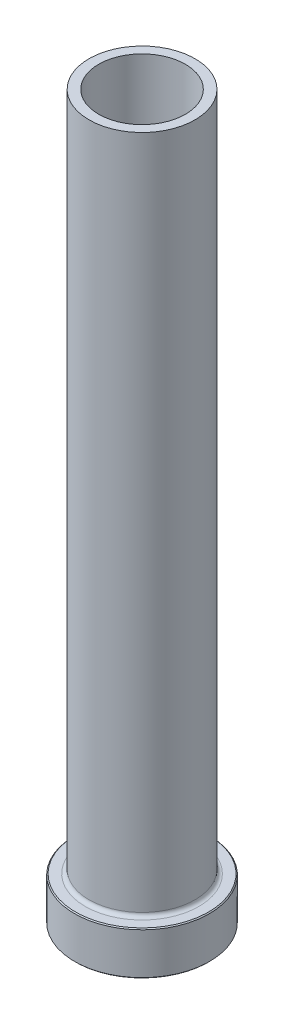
from build123d import *

# Parameters (mm, degrees)
FILLET1_R     = 0.8
CHAMFER1_SIZE = 0.2
CHAMFER3_SIZE = 0.5


with BuildPart() as part:
    # Sketch1 → Revolve1 (revolve)
    with BuildSketch(Plane.XY, mode=Mode.PRIVATE) as revolve1_sk:
        Polygon((-9, 150), (-11, 150), (-11, 9), (-14, 9), (-14, 0), (-9.25, 0), (-9.25, 83), (-9, 95), align=None)
    revolve(revolve1_sk.sketch.rotate(Axis((0, 92.187680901, 0), (0, -1, 0)), 270), axis=Axis((0, 92.187680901, 0), (0, -1, 0)))

    # Fillet1
    fillet1_edges = [part.edges().sort_by_distance(p)[0] for p in [
        (0, 9, -11),
    ]]
    fillet(fillet1_edges, radius=FILLET1_R)

    # Chamfer1
    chamfer1_edges = [part.edges().sort_by_distance(p)[0] for p in [
        (0, 0, -14),
        (0, 9, -14),
    ]]
    chamfer(chamfer1_edges, length=CHAMFER1_SIZE)

    # Chamfer3
    chamfer3_edges = [part.edges().sort_by_distance(p)[0] for p in [
        (0, 0, -9.25),
    ]]
    chamfer(chamfer3_edges, length=CHAMFER3_SIZE)


solid = part.part
